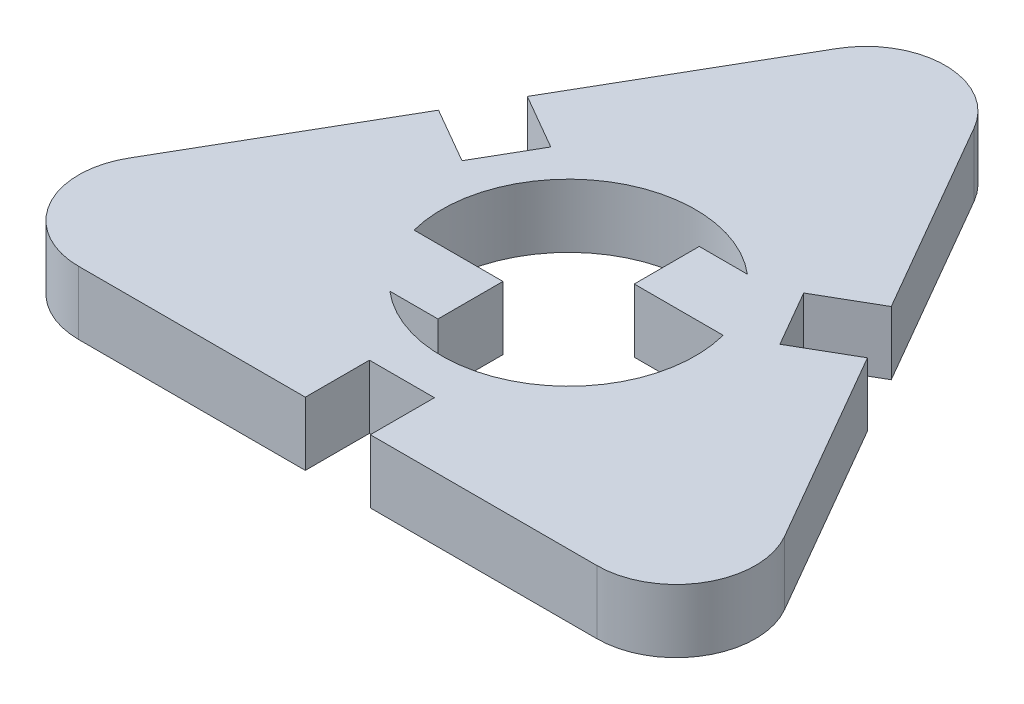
ISO-10303-21;
HEADER;
FILE_DESCRIPTION(('STEP AP214'),'2;1');
FILE_NAME('part.step','',(''),(''),'','','');
FILE_SCHEMA(('AUTOMOTIVE_DESIGN { 1 0 10303 214 1 1 1 1 }'));
ENDSEC;
DATA;
#1=APPLICATION_CONTEXT('core data for automotive mechanical design processes');
#2=APPLICATION_PROTOCOL_DEFINITION('international standard','automotive_design',2000,#1);
#3=PRODUCT_CONTEXT('',#1,'mechanical');
#4=PRODUCT('Part','Part','',(#3));
#5=PRODUCT_RELATED_PRODUCT_CATEGORY('part','',(#4));
#6=PRODUCT_DEFINITION_FORMATION('','',#4);
#7=PRODUCT_DEFINITION_CONTEXT('part definition',#1,'design');
#8=PRODUCT_DEFINITION('design','',#6,#7);
#9=PRODUCT_DEFINITION_SHAPE('','',#8);
#10=(LENGTH_UNIT() NAMED_UNIT(*) SI_UNIT(.MILLI.,.METRE.));
#11=(NAMED_UNIT(*) PLANE_ANGLE_UNIT() SI_UNIT($,.RADIAN.));
#12=(NAMED_UNIT(*) SI_UNIT($,.STERADIAN.) SOLID_ANGLE_UNIT());
#13=UNCERTAINTY_MEASURE_WITH_UNIT(LENGTH_MEASURE(1.E-05),#10,'distance_accuracy_value','');
#14=(GEOMETRIC_REPRESENTATION_CONTEXT(3) GLOBAL_UNCERTAINTY_ASSIGNED_CONTEXT((#13)) GLOBAL_UNIT_ASSIGNED_CONTEXT((#10,
#11,#12)) REPRESENTATION_CONTEXT('',''));
#15=CARTESIAN_POINT('',(0.,0.,0.));
#16=DIRECTION('',(0.,0.,1.));
#17=DIRECTION('',(1.,0.,0.));
#18=AXIS2_PLACEMENT_3D('',#15,#16,#17);
#19=CARTESIAN_POINT('',(2.05000000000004,4.,0.));
#20=DIRECTION('',(1.,0.,0.));
#21=DIRECTION('',(0.,0.,-1.));
#22=AXIS2_PLACEMENT_3D('',#19,#20,#21);
#23=PLANE('',#22);
#24=DIRECTION('',(0.,0.,1.));
#25=VECTOR('',#24,1.);
#26=CARTESIAN_POINT('',(2.05000000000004,0.,0.));
#27=LINE('',#26,#25);
#28=CARTESIAN_POINT('',(2.05000000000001,0.,10.5114568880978));
#29=VERTEX_POINT('',#28);
#30=CARTESIAN_POINT('',(2.04999999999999,0.,14.5536120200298));
#31=VERTEX_POINT('',#30);
#32=EDGE_CURVE('E350',#29,#31,#27,.T.);
#33=ORIENTED_EDGE('',*,*,#32,.T.);
#34=DIRECTION('',(0.,-1.,0.));
#35=VECTOR('',#34,1.);
#36=CARTESIAN_POINT('',(2.04999999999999,4.,14.5536120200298));
#37=LINE('',#36,#35);
#38=CARTESIAN_POINT('',(2.04999999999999,4.,14.5536120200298));
#39=VERTEX_POINT('',#38);
#40=EDGE_CURVE('E440',#39,#31,#37,.T.);
#41=ORIENTED_EDGE('',*,*,#40,.F.);
#42=DIRECTION('',(0.,0.,1.));
#43=VECTOR('',#42,1.);
#44=CARTESIAN_POINT('',(2.05000000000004,4.,0.));
#45=LINE('',#44,#43);
#46=CARTESIAN_POINT('',(2.05000000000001,4.,10.5114568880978));
#47=VERTEX_POINT('',#46);
#48=EDGE_CURVE('E268',#47,#39,#45,.T.);
#49=ORIENTED_EDGE('',*,*,#48,.F.);
#50=DIRECTION('',(0.,-1.,0.));
#51=VECTOR('',#50,1.);
#52=CARTESIAN_POINT('',(2.05000000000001,4.,10.5114568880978));
#53=LINE('',#52,#51);
#54=EDGE_CURVE('E228',#47,#29,#53,.T.);
#55=ORIENTED_EDGE('',*,*,#54,.T.);
#56=EDGE_LOOP('',(#33,#41,#49,#55));
#57=FACE_BOUND('',#56,.T.);
#58=ADVANCED_FACE('F41',(#57),#23,.F.);
#59=CARTESIAN_POINT('',(0.,4.,14.5536120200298));
#60=DIRECTION('',(0.,0.,-1.));
#61=DIRECTION('',(-1.,0.,0.));
#62=AXIS2_PLACEMENT_3D('',#59,#60,#61);
#63=PLANE('',#62);
#64=DIRECTION('',(1.,0.,0.));
#65=VECTOR('',#64,1.);
#66=CARTESIAN_POINT('',(0.,0.,14.5536120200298));
#67=LINE('',#66,#65);
#68=CARTESIAN_POINT('',(16.3397459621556,0.,14.5536120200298));
#69=VERTEX_POINT('',#68);
#70=EDGE_CURVE('E354',#31,#69,#67,.T.);
#71=ORIENTED_EDGE('',*,*,#70,.T.);
#72=DIRECTION('',(0.,-1.,0.));
#73=VECTOR('',#72,1.);
#74=CARTESIAN_POINT('',(16.3397459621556,4.,14.5536120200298));
#75=LINE('',#74,#73);
#76=CARTESIAN_POINT('',(16.3397459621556,4.,14.5536120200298));
#77=VERTEX_POINT('',#76);
#78=EDGE_CURVE('E476',#69,#77,#75,.F.);
#79=ORIENTED_EDGE('',*,*,#78,.T.);
#80=DIRECTION('',(1.,0.,0.));
#81=VECTOR('',#80,1.);
#82=CARTESIAN_POINT('',(0.,4.,14.5536120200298));
#83=LINE('',#82,#81);
#84=EDGE_CURVE('E272',#39,#77,#83,.T.);
#85=ORIENTED_EDGE('',*,*,#84,.F.);
#86=ORIENTED_EDGE('',*,*,#40,.T.);
#87=EDGE_LOOP('',(#71,#79,#85,#86));
#88=FACE_BOUND('',#87,.T.);
#89=ADVANCED_FACE('F541',(#88),#63,.F.);
#90=CARTESIAN_POINT('',(12.4481011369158,4.,-7.18691454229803));
#91=DIRECTION('',(-0.866025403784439,0.,0.5));
#92=DIRECTION('',(0.5,0.,0.866025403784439));
#93=AXIS2_PLACEMENT_3D('',#90,#91,#92);
#94=PLANE('',#93);
#95=DIRECTION('',(-0.5,0.,-0.866025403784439));
#96=VECTOR('',#95,1.);
#97=CARTESIAN_POINT('',(12.4481011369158,4.,-7.18691454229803));
#98=LINE('',#97,#96);
#99=CARTESIAN_POINT('',(20.6698729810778,4.,7.05361202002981));
#100=VERTEX_POINT('',#99);
#101=CARTESIAN_POINT('',(13.525,4.,-5.32167099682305));
#102=VERTEX_POINT('',#101);
#103=EDGE_CURVE('E276',#100,#102,#98,.T.);
#104=ORIENTED_EDGE('',*,*,#103,.F.);
#105=DIRECTION('',(0.,-1.,0.));
#106=VECTOR('',#105,1.);
#107=CARTESIAN_POINT('',(20.6698729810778,4.,7.05361202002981));
#108=LINE('',#107,#106);
#109=CARTESIAN_POINT('',(20.6698729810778,0.,7.05361202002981));
#110=VERTEX_POINT('',#109);
#111=EDGE_CURVE('E444',#100,#110,#108,.T.);
#112=ORIENTED_EDGE('',*,*,#111,.T.);
#113=DIRECTION('',(-0.5,0.,-0.866025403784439));
#114=VECTOR('',#113,1.);
#115=CARTESIAN_POINT('',(12.4481011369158,0.,-7.18691454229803));
#116=LINE('',#115,#114);
#117=CARTESIAN_POINT('',(13.525,0.,-5.32167099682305));
#118=VERTEX_POINT('',#117);
#119=EDGE_CURVE('E358',#110,#118,#116,.T.);
#120=ORIENTED_EDGE('',*,*,#119,.T.);
#121=DIRECTION('',(0.,-1.,0.));
#122=VECTOR('',#121,1.);
#123=CARTESIAN_POINT('',(13.525,4.,-5.32167099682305));
#124=LINE('',#123,#122);
#125=EDGE_CURVE('E436',#102,#118,#124,.T.);
#126=ORIENTED_EDGE('',*,*,#125,.F.);
#127=EDGE_LOOP('',(#104,#112,#120,#126));
#128=FACE_BOUND('',#127,.T.);
#129=ADVANCED_FACE('F549',(#128),#94,.F.);
#130=CARTESIAN_POINT('',(1.07689886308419,4.,1.86524354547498));
#131=DIRECTION('',(-0.5,0.,-0.866025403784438));
#132=DIRECTION('',(-0.866025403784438,0.,0.5));
#133=AXIS2_PLACEMENT_3D('',#130,#131,#132);
#134=PLANE('',#133);
#135=DIRECTION('',(0.866025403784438,0.,-0.5));
#136=VECTOR('',#135,1.);
#137=CARTESIAN_POINT('',(1.07689886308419,0.,1.86524354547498));
#138=LINE('',#137,#136);
#139=CARTESIAN_POINT('',(10.0243909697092,0.,-3.30059343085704));
#140=VERTEX_POINT('',#139);
#141=EDGE_CURVE('E361',#140,#118,#138,.T.);
#142=ORIENTED_EDGE('',*,*,#141,.F.);
#143=DIRECTION('',(0.,-1.,0.));
#144=VECTOR('',#143,1.);
#145=CARTESIAN_POINT('',(10.0243909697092,4.,-3.30059343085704));
#146=LINE('',#145,#144);
#147=CARTESIAN_POINT('',(10.0243909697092,4.,-3.30059343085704));
#148=VERTEX_POINT('',#147);
#149=EDGE_CURVE('E433',#148,#140,#146,.T.);
#150=ORIENTED_EDGE('',*,*,#149,.F.);
#151=DIRECTION('',(0.866025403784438,0.,-0.5));
#152=VECTOR('',#151,1.);
#153=CARTESIAN_POINT('',(1.07689886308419,4.,1.86524354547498));
#154=LINE('',#153,#152);
#155=EDGE_CURVE('E279',#148,#102,#154,.T.);
#156=ORIENTED_EDGE('',*,*,#155,.T.);
#157=ORIENTED_EDGE('',*,*,#125,.T.);
#158=EDGE_LOOP('',(#142,#150,#156,#157));
#159=FACE_BOUND('',#158,.T.);
#160=ADVANCED_FACE('F555',(#159),#134,.T.);
#161=CARTESIAN_POINT('',(8.94749210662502,4.,-5.16583697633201));
#162=DIRECTION('',(-0.866025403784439,0.,0.5));
#163=DIRECTION('',(0.5,0.,0.866025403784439));
#164=AXIS2_PLACEMENT_3D('',#161,#162,#163);
#165=PLANE('',#164);
#166=DIRECTION('',(-0.5,0.,-0.866025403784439));
#167=VECTOR('',#166,1.);
#168=CARTESIAN_POINT('',(8.94749210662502,0.,-5.16583697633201));
#169=LINE('',#168,#167);
#170=CARTESIAN_POINT('',(7.97439096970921,0.,-6.85129758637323));
#171=VERTEX_POINT('',#170);
#172=EDGE_CURVE('E365',#140,#171,#169,.T.);
#173=ORIENTED_EDGE('',*,*,#172,.T.);
#174=DIRECTION('',(0.,-1.,0.));
#175=VECTOR('',#174,1.);
#176=CARTESIAN_POINT('',(7.97439096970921,4.,-6.85129758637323));
#177=LINE('',#176,#175);
#178=CARTESIAN_POINT('',(7.97439096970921,4.,-6.85129758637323));
#179=VERTEX_POINT('',#178);
#180=EDGE_CURVE('E429',#179,#171,#177,.T.);
#181=ORIENTED_EDGE('',*,*,#180,.F.);
#182=DIRECTION('',(-0.5,0.,-0.866025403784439));
#183=VECTOR('',#182,1.);
#184=CARTESIAN_POINT('',(8.94749210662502,4.,-5.16583697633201));
#185=LINE('',#184,#183);
#186=EDGE_CURVE('E283',#148,#179,#185,.T.);
#187=ORIENTED_EDGE('',*,*,#186,.F.);
#188=ORIENTED_EDGE('',*,*,#149,.T.);
#189=EDGE_LOOP('',(#173,#181,#187,#188));
#190=FACE_BOUND('',#189,.T.);
#191=ADVANCED_FACE('F562',(#190),#165,.F.);
#192=CARTESIAN_POINT('',(-0.973101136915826,4.,-1.68546061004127));
#193=DIRECTION('',(-0.499999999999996,0.,-0.866025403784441));
#194=DIRECTION('',(-0.866025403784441,0.,0.499999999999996));
#195=AXIS2_PLACEMENT_3D('',#192,#193,#194);
#196=PLANE('',#195);
#197=DIRECTION('',(0.866025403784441,0.,-0.499999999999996));
#198=VECTOR('',#197,1.);
#199=CARTESIAN_POINT('',(-0.973101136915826,0.,-1.68546061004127));
#200=LINE('',#199,#198);
#201=CARTESIAN_POINT('',(11.475,0.,-8.87237515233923));
#202=VERTEX_POINT('',#201);
#203=EDGE_CURVE('E368',#171,#202,#200,.T.);
#204=ORIENTED_EDGE('',*,*,#203,.T.);
#205=DIRECTION('',(0.,-1.,0.));
#206=VECTOR('',#205,1.);
#207=CARTESIAN_POINT('',(11.475,4.,-8.87237515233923));
#208=LINE('',#207,#206);
#209=CARTESIAN_POINT('',(11.475,4.,-8.87237515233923));
#210=VERTEX_POINT('',#209);
#211=EDGE_CURVE('E425',#210,#202,#208,.T.);
#212=ORIENTED_EDGE('',*,*,#211,.F.);
#213=DIRECTION('',(0.866025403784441,0.,-0.499999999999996));
#214=VECTOR('',#213,1.);
#215=CARTESIAN_POINT('',(-0.973101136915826,4.,-1.68546061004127));
#216=LINE('',#215,#214);
#217=EDGE_CURVE('E286',#179,#210,#216,.T.);
#218=ORIENTED_EDGE('',*,*,#217,.F.);
#219=ORIENTED_EDGE('',*,*,#180,.T.);
#220=EDGE_LOOP('',(#204,#212,#218,#219));
#221=FACE_BOUND('',#220,.T.);
#222=ADVANCED_FACE('F564',(#221),#196,.F.);
#223=CARTESIAN_POINT('',(12.4481011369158,4.,-7.18691454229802));
#224=DIRECTION('',(-0.866025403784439,0.,0.5));
#225=DIRECTION('',(0.5,0.,0.866025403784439));
#226=AXIS2_PLACEMENT_3D('',#223,#224,#225);
#227=PLANE('',#226);
#228=DIRECTION('',(-0.5,0.,-0.866025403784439));
#229=VECTOR('',#228,1.);
#230=CARTESIAN_POINT('',(12.4481011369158,0.,-7.18691454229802));
#231=LINE('',#230,#229);
#232=CARTESIAN_POINT('',(4.3301270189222,0.,-21.2476581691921));
#233=VERTEX_POINT('',#232);
#234=EDGE_CURVE('E371',#202,#233,#231,.T.);
#235=ORIENTED_EDGE('',*,*,#234,.T.);
#236=DIRECTION('',(0.,-1.,0.));
#237=VECTOR('',#236,1.);
#238=CARTESIAN_POINT('',(4.3301270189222,4.,-21.2476581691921));
#239=LINE('',#238,#237);
#240=CARTESIAN_POINT('',(4.3301270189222,4.,-21.2476581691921));
#241=VERTEX_POINT('',#240);
#242=EDGE_CURVE('E11',#233,#241,#239,.F.);
#243=ORIENTED_EDGE('',*,*,#242,.T.);
#244=DIRECTION('',(-0.5,0.,-0.866025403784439));
#245=VECTOR('',#244,1.);
#246=CARTESIAN_POINT('',(12.4481011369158,4.,-7.18691454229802));
#247=LINE('',#246,#245);
#248=EDGE_CURVE('E289',#210,#241,#247,.T.);
#249=ORIENTED_EDGE('',*,*,#248,.F.);
#250=ORIENTED_EDGE('',*,*,#211,.T.);
#251=EDGE_LOOP('',(#235,#243,#249,#250));
#252=FACE_BOUND('',#251,.T.);
#253=ADVANCED_FACE('F567',(#252),#227,.F.);
#254=CARTESIAN_POINT('',(-12.4481011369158,4.,-7.18691454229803));
#255=DIRECTION('',(0.866025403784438,0.,0.5));
#256=DIRECTION('',(0.5,0.,-0.866025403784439));
#257=AXIS2_PLACEMENT_3D('',#254,#255,#256);
#258=PLANE('',#257);
#259=DIRECTION('',(-0.5,0.,0.866025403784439));
#260=VECTOR('',#259,1.);
#261=CARTESIAN_POINT('',(-12.4481011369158,4.,-7.18691454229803));
#262=LINE('',#261,#260);
#263=CARTESIAN_POINT('',(-4.33012701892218,4.,-21.2476581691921));
#264=VERTEX_POINT('',#263);
#265=CARTESIAN_POINT('',(-11.475,4.,-8.87237515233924));
#266=VERTEX_POINT('',#265);
#267=EDGE_CURVE('E293',#264,#266,#262,.T.);
#268=ORIENTED_EDGE('',*,*,#267,.F.);
#269=DIRECTION('',(0.,-1.,0.));
#270=VECTOR('',#269,1.);
#271=CARTESIAN_POINT('',(-4.33012701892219,4.,-21.2476581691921));
#272=LINE('',#271,#270);
#273=CARTESIAN_POINT('',(-4.33012701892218,0.,-21.2476581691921));
#274=VERTEX_POINT('',#273);
#275=EDGE_CURVE('E50',#264,#274,#272,.T.);
#276=ORIENTED_EDGE('',*,*,#275,.T.);
#277=DIRECTION('',(-0.5,0.,0.866025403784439));
#278=VECTOR('',#277,1.);
#279=CARTESIAN_POINT('',(-12.4481011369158,0.,-7.18691454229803));
#280=LINE('',#279,#278);
#281=CARTESIAN_POINT('',(-11.475,0.,-8.87237515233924));
#282=VERTEX_POINT('',#281);
#283=EDGE_CURVE('E375',#274,#282,#280,.T.);
#284=ORIENTED_EDGE('',*,*,#283,.T.);
#285=DIRECTION('',(0.,-1.,0.));
#286=VECTOR('',#285,1.);
#287=CARTESIAN_POINT('',(-11.475,4.,-8.87237515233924));
#288=LINE('',#287,#286);
#289=EDGE_CURVE('E421',#266,#282,#288,.T.);
#290=ORIENTED_EDGE('',*,*,#289,.F.);
#291=EDGE_LOOP('',(#268,#276,#284,#290));
#292=FACE_BOUND('',#291,.T.);
#293=ADVANCED_FACE('F498',(#292),#258,.F.);
#294=CARTESIAN_POINT('',(0.973101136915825,4.,-1.68546061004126));
#295=DIRECTION('',(-0.499999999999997,0.,0.866025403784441));
#296=DIRECTION('',(0.866025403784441,0.,0.499999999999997));
#297=AXIS2_PLACEMENT_3D('',#294,#295,#296);
#298=PLANE('',#297);
#299=DIRECTION('',(-0.866025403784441,0.,-0.499999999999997));
#300=VECTOR('',#299,1.);
#301=CARTESIAN_POINT('',(0.973101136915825,0.,-1.68546061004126));
#302=LINE('',#301,#300);
#303=CARTESIAN_POINT('',(-7.97439096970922,0.,-6.85129758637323));
#304=VERTEX_POINT('',#303);
#305=EDGE_CURVE('E378',#304,#282,#302,.T.);
#306=ORIENTED_EDGE('',*,*,#305,.F.);
#307=DIRECTION('',(0.,-1.,0.));
#308=VECTOR('',#307,1.);
#309=CARTESIAN_POINT('',(-7.97439096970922,4.,-6.85129758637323));
#310=LINE('',#309,#308);
#311=CARTESIAN_POINT('',(-7.97439096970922,4.,-6.85129758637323));
#312=VERTEX_POINT('',#311);
#313=EDGE_CURVE('E418',#312,#304,#310,.T.);
#314=ORIENTED_EDGE('',*,*,#313,.F.);
#315=DIRECTION('',(-0.866025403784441,0.,-0.499999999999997));
#316=VECTOR('',#315,1.);
#317=CARTESIAN_POINT('',(0.973101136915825,4.,-1.68546061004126));
#318=LINE('',#317,#316);
#319=EDGE_CURVE('E296',#312,#266,#318,.T.);
#320=ORIENTED_EDGE('',*,*,#319,.T.);
#321=ORIENTED_EDGE('',*,*,#289,.T.);
#322=EDGE_LOOP('',(#306,#314,#320,#321));
#323=FACE_BOUND('',#322,.T.);
#324=ADVANCED_FACE('F510',(#323),#298,.T.);
#325=CARTESIAN_POINT('',(-8.94749210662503,4.,-5.16583697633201));
#326=DIRECTION('',(-0.866025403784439,0.,-0.5));
#327=DIRECTION('',(-0.5,0.,0.866025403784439));
#328=AXIS2_PLACEMENT_3D('',#325,#326,#327);
#329=PLANE('',#328);
#330=DIRECTION('',(0.5,0.,-0.866025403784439));
#331=VECTOR('',#330,1.);
#332=CARTESIAN_POINT('',(-8.94749210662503,0.,-5.16583697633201));
#333=LINE('',#332,#331);
#334=CARTESIAN_POINT('',(-10.0243909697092,0.,-3.30059343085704));
#335=VERTEX_POINT('',#334);
#336=EDGE_CURVE('E382',#335,#304,#333,.T.);
#337=ORIENTED_EDGE('',*,*,#336,.F.);
#338=DIRECTION('',(0.,-1.,0.));
#339=VECTOR('',#338,1.);
#340=CARTESIAN_POINT('',(-10.0243909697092,4.,-3.30059343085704));
#341=LINE('',#340,#339);
#342=CARTESIAN_POINT('',(-10.0243909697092,4.,-3.30059343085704));
#343=VERTEX_POINT('',#342);
#344=EDGE_CURVE('E415',#343,#335,#341,.T.);
#345=ORIENTED_EDGE('',*,*,#344,.F.);
#346=DIRECTION('',(0.5,0.,-0.866025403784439));
#347=VECTOR('',#346,1.);
#348=CARTESIAN_POINT('',(-8.94749210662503,4.,-5.16583697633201));
#349=LINE('',#348,#347);
#350=EDGE_CURVE('E300',#343,#312,#349,.T.);
#351=ORIENTED_EDGE('',*,*,#350,.T.);
#352=ORIENTED_EDGE('',*,*,#313,.T.);
#353=EDGE_LOOP('',(#337,#345,#351,#352));
#354=FACE_BOUND('',#353,.T.);
#355=ADVANCED_FACE('F514',(#354),#329,.T.);
#356=CARTESIAN_POINT('',(-1.07689886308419,4.,1.86524354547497));
#357=DIRECTION('',(-0.5,0.,0.866025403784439));
#358=DIRECTION('',(0.866025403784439,0.,0.5));
#359=AXIS2_PLACEMENT_3D('',#356,#357,#358);
#360=PLANE('',#359);
#361=DIRECTION('',(-0.866025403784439,0.,-0.5));
#362=VECTOR('',#361,1.);
#363=CARTESIAN_POINT('',(-1.07689886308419,0.,1.86524354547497));
#364=LINE('',#363,#362);
#365=CARTESIAN_POINT('',(-13.525,0.,-5.32167099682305));
#366=VERTEX_POINT('',#365);
#367=EDGE_CURVE('E386',#335,#366,#364,.T.);
#368=ORIENTED_EDGE('',*,*,#367,.T.);
#369=DIRECTION('',(0.,-1.,0.));
#370=VECTOR('',#369,1.);
#371=CARTESIAN_POINT('',(-13.525,4.,-5.32167099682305));
#372=LINE('',#371,#370);
#373=CARTESIAN_POINT('',(-13.525,4.,-5.32167099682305));
#374=VERTEX_POINT('',#373);
#375=EDGE_CURVE('E411',#374,#366,#372,.T.);
#376=ORIENTED_EDGE('',*,*,#375,.F.);
#377=DIRECTION('',(-0.866025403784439,0.,-0.5));
#378=VECTOR('',#377,1.);
#379=CARTESIAN_POINT('',(-1.07689886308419,4.,1.86524354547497));
#380=LINE('',#379,#378);
#381=EDGE_CURVE('E304',#343,#374,#380,.T.);
#382=ORIENTED_EDGE('',*,*,#381,.F.);
#383=ORIENTED_EDGE('',*,*,#344,.T.);
#384=EDGE_LOOP('',(#368,#376,#382,#383));
#385=FACE_BOUND('',#384,.T.);
#386=ADVANCED_FACE('F518',(#385),#360,.F.);
#387=CARTESIAN_POINT('',(-12.4481011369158,4.,-7.18691454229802));
#388=DIRECTION('',(0.866025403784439,0.,0.5));
#389=DIRECTION('',(0.5,0.,-0.866025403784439));
#390=AXIS2_PLACEMENT_3D('',#387,#388,#389);
#391=PLANE('',#390);
#392=DIRECTION('',(-0.5,0.,0.866025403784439));
#393=VECTOR('',#392,1.);
#394=CARTESIAN_POINT('',(-12.4481011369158,0.,-7.18691454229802));
#395=LINE('',#394,#393);
#396=CARTESIAN_POINT('',(-20.6698729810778,0.,7.05361202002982));
#397=VERTEX_POINT('',#396);
#398=EDGE_CURVE('E389',#366,#397,#395,.T.);
#399=ORIENTED_EDGE('',*,*,#398,.T.);
#400=DIRECTION('',(0.,-1.,0.));
#401=VECTOR('',#400,1.);
#402=CARTESIAN_POINT('',(-20.6698729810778,4.,7.05361202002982));
#403=LINE('',#402,#401);
#404=CARTESIAN_POINT('',(-20.6698729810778,4.,7.05361202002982));
#405=VERTEX_POINT('',#404);
#406=EDGE_CURVE('E65',#397,#405,#403,.F.);
#407=ORIENTED_EDGE('',*,*,#406,.T.);
#408=DIRECTION('',(-0.5,0.,0.866025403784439));
#409=VECTOR('',#408,1.);
#410=CARTESIAN_POINT('',(-12.4481011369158,4.,-7.18691454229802));
#411=LINE('',#410,#409);
#412=EDGE_CURVE('E307',#374,#405,#411,.T.);
#413=ORIENTED_EDGE('',*,*,#412,.F.);
#414=ORIENTED_EDGE('',*,*,#375,.T.);
#415=EDGE_LOOP('',(#399,#407,#413,#414));
#416=FACE_BOUND('',#415,.T.);
#417=ADVANCED_FACE('F626',(#416),#391,.F.);
#418=CARTESIAN_POINT('',(0.,4.,14.5536120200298));
#419=DIRECTION('',(0.,0.,-1.));
#420=DIRECTION('',(-1.,0.,0.));
#421=AXIS2_PLACEMENT_3D('',#418,#419,#420);
#422=PLANE('',#421);
#423=DIRECTION('',(1.,0.,0.));
#424=VECTOR('',#423,1.);
#425=CARTESIAN_POINT('',(0.,4.,14.5536120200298));
#426=LINE('',#425,#424);
#427=CARTESIAN_POINT('',(-16.3397459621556,4.,14.5536120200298));
#428=VERTEX_POINT('',#427);
#429=CARTESIAN_POINT('',(-2.04999999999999,4.,14.5536120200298));
#430=VERTEX_POINT('',#429);
#431=EDGE_CURVE('E310',#428,#430,#426,.T.);
#432=ORIENTED_EDGE('',*,*,#431,.F.);
#433=DIRECTION('',(0.,-1.,0.));
#434=VECTOR('',#433,1.);
#435=CARTESIAN_POINT('',(-16.3397459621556,4.,14.5536120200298));
#436=LINE('',#435,#434);
#437=CARTESIAN_POINT('',(-16.3397459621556,0.,14.5536120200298));
#438=VERTEX_POINT('',#437);
#439=EDGE_CURVE('E487',#428,#438,#436,.T.);
#440=ORIENTED_EDGE('',*,*,#439,.T.);
#441=DIRECTION('',(1.,0.,0.));
#442=VECTOR('',#441,1.);
#443=CARTESIAN_POINT('',(0.,0.,14.5536120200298));
#444=LINE('',#443,#442);
#445=CARTESIAN_POINT('',(-2.04999999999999,0.,14.5536120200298));
#446=VERTEX_POINT('',#445);
#447=EDGE_CURVE('E392',#438,#446,#444,.T.);
#448=ORIENTED_EDGE('',*,*,#447,.T.);
#449=DIRECTION('',(0.,-1.,0.));
#450=VECTOR('',#449,1.);
#451=CARTESIAN_POINT('',(-2.04999999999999,4.,14.5536120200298));
#452=LINE('',#451,#450);
#453=EDGE_CURVE('E407',#430,#446,#452,.T.);
#454=ORIENTED_EDGE('',*,*,#453,.F.);
#455=EDGE_LOOP('',(#432,#440,#448,#454));
#456=FACE_BOUND('',#455,.T.);
#457=ADVANCED_FACE('F524',(#456),#422,.F.);
#458=CARTESIAN_POINT('',(-2.04999999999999,4.,0.));
#459=DIRECTION('',(1.,0.,0.));
#460=DIRECTION('',(0.,0.,-1.));
#461=AXIS2_PLACEMENT_3D('',#458,#459,#460);
#462=PLANE('',#461);
#463=DIRECTION('',(0.,0.,1.));
#464=VECTOR('',#463,1.);
#465=CARTESIAN_POINT('',(-2.04999999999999,0.,0.));
#466=LINE('',#465,#464);
#467=CARTESIAN_POINT('',(-2.04999999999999,0.,10.5114568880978));
#468=VERTEX_POINT('',#467);
#469=EDGE_CURVE('E395',#468,#446,#466,.T.);
#470=ORIENTED_EDGE('',*,*,#469,.F.);
#471=DIRECTION('',(0.,-1.,0.));
#472=VECTOR('',#471,1.);
#473=CARTESIAN_POINT('',(-2.04999999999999,4.,10.5114568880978));
#474=LINE('',#473,#472);
#475=CARTESIAN_POINT('',(-2.04999999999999,4.,10.5114568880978));
#476=VERTEX_POINT('',#475);
#477=EDGE_CURVE('E404',#476,#468,#474,.T.);
#478=ORIENTED_EDGE('',*,*,#477,.F.);
#479=DIRECTION('',(0.,0.,1.));
#480=VECTOR('',#479,1.);
#481=CARTESIAN_POINT('',(-2.04999999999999,4.,0.));
#482=LINE('',#481,#480);
#483=EDGE_CURVE('E313',#476,#430,#482,.T.);
#484=ORIENTED_EDGE('',*,*,#483,.T.);
#485=ORIENTED_EDGE('',*,*,#453,.T.);
#486=EDGE_LOOP('',(#470,#478,#484,#485));
#487=FACE_BOUND('',#486,.T.);
#488=ADVANCED_FACE('F531',(#487),#462,.T.);
#489=CARTESIAN_POINT('',(0.,4.,2.00000000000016));
#490=DIRECTION('',(0.,0.,-1.));
#491=DIRECTION('',(-1.,0.,0.));
#492=AXIS2_PLACEMENT_3D('',#489,#490,#491);
#493=PLANE('',#492);
#494=DIRECTION('',(1.,0.,0.));
#495=VECTOR('',#494,1.);
#496=CARTESIAN_POINT('',(0.,0.,2.00000000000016));
#497=LINE('',#496,#495);
#498=CARTESIAN_POINT('',(-7.74596669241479,0.,2.00000000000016));
#499=VERTEX_POINT('',#498);
#500=CARTESIAN_POINT('',(-2.14004370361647,0.,2.00000000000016));
#501=VERTEX_POINT('',#500);
#502=EDGE_CURVE('E222',#499,#501,#497,.T.);
#503=ORIENTED_EDGE('',*,*,#502,.F.);
#504=DIRECTION('',(0.,-1.,0.));
#505=VECTOR('',#504,1.);
#506=CARTESIAN_POINT('',(-7.74596669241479,4.,2.00000000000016));
#507=LINE('',#506,#505);
#508=CARTESIAN_POINT('',(-7.74596669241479,4.,2.00000000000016));
#509=VERTEX_POINT('',#508);
#510=EDGE_CURVE('E216',#509,#499,#507,.T.);
#511=ORIENTED_EDGE('',*,*,#510,.F.);
#512=DIRECTION('',(1.,0.,0.));
#513=VECTOR('',#512,1.);
#514=CARTESIAN_POINT('',(0.,4.,2.00000000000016));
#515=LINE('',#514,#513);
#516=CARTESIAN_POINT('',(-2.14004370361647,4.,2.00000000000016));
#517=VERTEX_POINT('',#516);
#518=EDGE_CURVE('E219',#509,#517,#515,.T.);
#519=ORIENTED_EDGE('',*,*,#518,.T.);
#520=DIRECTION('',(0.,-1.,0.));
#521=VECTOR('',#520,1.);
#522=CARTESIAN_POINT('',(-2.14004370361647,4.,2.00000000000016));
#523=LINE('',#522,#521);
#524=EDGE_CURVE('E320',#517,#501,#523,.T.);
#525=ORIENTED_EDGE('',*,*,#524,.T.);
#526=EDGE_LOOP('',(#503,#511,#519,#525));
#527=FACE_BOUND('',#526,.T.);
#528=ADVANCED_FACE('F218',(#527),#493,.T.);
#529=CARTESIAN_POINT('',(0.,4.,0.));
#530=DIRECTION('',(0.,-1.,0.));
#531=DIRECTION('',(0.,0.,-1.));
#532=AXIS2_PLACEMENT_3D('',#529,#530,#531);
#533=CYLINDRICAL_SURFACE('',#532,8.);
#534=CARTESIAN_POINT('',(0.,0.,0.));
#535=DIRECTION('',(0.,1.,0.));
#536=DIRECTION('',(0.,0.,1.));
#537=AXIS2_PLACEMENT_3D('',#534,#535,#536);
#538=CIRCLE('',#537,8.);
#539=CARTESIAN_POINT('',(5.17590571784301,0.,-6.1));
#540=VERTEX_POINT('',#539);
#541=EDGE_CURVE('E323',#540,#499,#538,.T.);
#542=ORIENTED_EDGE('',*,*,#541,.F.);
#543=DIRECTION('',(0.,-1.,0.));
#544=VECTOR('',#543,1.);
#545=CARTESIAN_POINT('',(5.17590571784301,4.,-6.1));
#546=LINE('',#545,#544);
#547=CARTESIAN_POINT('',(5.17590571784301,4.,-6.1));
#548=VERTEX_POINT('',#547);
#549=EDGE_CURVE('E229',#548,#540,#546,.T.);
#550=ORIENTED_EDGE('',*,*,#549,.F.);
#551=CARTESIAN_POINT('',(0.,4.,0.));
#552=DIRECTION('',(0.,1.,0.));
#553=DIRECTION('',(0.,0.,1.));
#554=AXIS2_PLACEMENT_3D('',#551,#552,#553);
#555=CIRCLE('',#554,8.);
#556=EDGE_CURVE('E235',#548,#509,#555,.T.);
#557=ORIENTED_EDGE('',*,*,#556,.T.);
#558=ORIENTED_EDGE('',*,*,#510,.T.);
#559=EDGE_LOOP('',(#542,#550,#557,#558));
#560=FACE_BOUND('',#559,.T.);
#561=ADVANCED_FACE('F243',(#560),#533,.F.);
#562=CARTESIAN_POINT('',(0.,4.,-6.1));
#563=DIRECTION('',(0.,0.,-1.));
#564=DIRECTION('',(-1.,0.,0.));
#565=AXIS2_PLACEMENT_3D('',#562,#563,#564);
#566=PLANE('',#565);
#567=DIRECTION('',(1.,0.,0.));
#568=VECTOR('',#567,1.);
#569=CARTESIAN_POINT('',(0.,0.,-6.1));
#570=LINE('',#569,#568);
#571=CARTESIAN_POINT('',(2.1400437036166,0.,-6.1));
#572=VERTEX_POINT('',#571);
#573=EDGE_CURVE('E326',#572,#540,#570,.T.);
#574=ORIENTED_EDGE('',*,*,#573,.F.);
#575=DIRECTION('',(0.,-1.,0.));
#576=VECTOR('',#575,1.);
#577=CARTESIAN_POINT('',(2.1400437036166,4.,-6.1));
#578=LINE('',#577,#576);
#579=CARTESIAN_POINT('',(2.1400437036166,4.,-6.1));
#580=VERTEX_POINT('',#579);
#581=EDGE_CURVE('E459',#580,#572,#578,.T.);
#582=ORIENTED_EDGE('',*,*,#581,.F.);
#583=DIRECTION('',(1.,0.,0.));
#584=VECTOR('',#583,1.);
#585=CARTESIAN_POINT('',(0.,4.,-6.1));
#586=LINE('',#585,#584);
#587=EDGE_CURVE('E245',#580,#548,#586,.T.);
#588=ORIENTED_EDGE('',*,*,#587,.T.);
#589=ORIENTED_EDGE('',*,*,#549,.T.);
#590=EDGE_LOOP('',(#574,#582,#588,#589));
#591=FACE_BOUND('',#590,.T.);
#592=ADVANCED_FACE('F600',(#591),#566,.T.);
#593=CARTESIAN_POINT('',(2.1400437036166,4.,0.));
#594=DIRECTION('',(-1.,0.,0.));
#595=DIRECTION('',(0.,0.,1.));
#596=AXIS2_PLACEMENT_3D('',#593,#594,#595);
#597=PLANE('',#596);
#598=DIRECTION('',(0.,0.,-1.));
#599=VECTOR('',#598,1.);
#600=CARTESIAN_POINT('',(2.1400437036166,0.,0.));
#601=LINE('',#600,#599);
#602=CARTESIAN_POINT('',(2.1400437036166,0.,-2.));
#603=VERTEX_POINT('',#602);
#604=EDGE_CURVE('E330',#603,#572,#601,.T.);
#605=ORIENTED_EDGE('',*,*,#604,.F.);
#606=DIRECTION('',(0.,-1.,0.));
#607=VECTOR('',#606,1.);
#608=CARTESIAN_POINT('',(2.1400437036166,4.,-2.));
#609=LINE('',#608,#607);
#610=CARTESIAN_POINT('',(2.1400437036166,4.,-2.));
#611=VERTEX_POINT('',#610);
#612=EDGE_CURVE('E456',#611,#603,#609,.T.);
#613=ORIENTED_EDGE('',*,*,#612,.F.);
#614=DIRECTION('',(0.,0.,-1.));
#615=VECTOR('',#614,1.);
#616=CARTESIAN_POINT('',(2.1400437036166,4.,0.));
#617=LINE('',#616,#615);
#618=EDGE_CURVE('E248',#611,#580,#617,.T.);
#619=ORIENTED_EDGE('',*,*,#618,.T.);
#620=ORIENTED_EDGE('',*,*,#581,.T.);
#621=EDGE_LOOP('',(#605,#613,#619,#620));
#622=FACE_BOUND('',#621,.T.);
#623=ADVANCED_FACE('F596',(#622),#597,.T.);
#624=CARTESIAN_POINT('',(0.,4.,-2.));
#625=DIRECTION('',(0.,0.,1.));
#626=DIRECTION('',(1.,0.,0.));
#627=AXIS2_PLACEMENT_3D('',#624,#625,#626);
#628=PLANE('',#627);
#629=DIRECTION('',(-1.,0.,0.));
#630=VECTOR('',#629,1.);
#631=CARTESIAN_POINT('',(0.,0.,-2.));
#632=LINE('',#631,#630);
#633=CARTESIAN_POINT('',(7.74596669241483,0.,-2.));
#634=VERTEX_POINT('',#633);
#635=EDGE_CURVE('E334',#634,#603,#632,.T.);
#636=ORIENTED_EDGE('',*,*,#635,.F.);
#637=DIRECTION('',(0.,-1.,0.));
#638=VECTOR('',#637,1.);
#639=CARTESIAN_POINT('',(7.74596669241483,4.,-2.));
#640=LINE('',#639,#638);
#641=CARTESIAN_POINT('',(7.74596669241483,4.,-2.));
#642=VERTEX_POINT('',#641);
#643=EDGE_CURVE('E453',#642,#634,#640,.T.);
#644=ORIENTED_EDGE('',*,*,#643,.F.);
#645=DIRECTION('',(-1.,0.,0.));
#646=VECTOR('',#645,1.);
#647=CARTESIAN_POINT('',(0.,4.,-2.));
#648=LINE('',#647,#646);
#649=EDGE_CURVE('E254',#642,#611,#648,.T.);
#650=ORIENTED_EDGE('',*,*,#649,.T.);
#651=ORIENTED_EDGE('',*,*,#612,.T.);
#652=EDGE_LOOP('',(#636,#644,#650,#651));
#653=FACE_BOUND('',#652,.T.);
#654=ADVANCED_FACE('F592',(#653),#628,.T.);
#655=CARTESIAN_POINT('',(0.,4.,0.));
#656=DIRECTION('',(0.,-1.,0.));
#657=DIRECTION('',(0.,0.,-1.));
#658=AXIS2_PLACEMENT_3D('',#655,#656,#657);
#659=CYLINDRICAL_SURFACE('',#658,8.);
#660=CARTESIAN_POINT('',(0.,0.,0.));
#661=DIRECTION('',(0.,1.,0.));
#662=DIRECTION('',(0.,0.,1.));
#663=AXIS2_PLACEMENT_3D('',#660,#661,#662);
#664=CIRCLE('',#663,8.);
#665=CARTESIAN_POINT('',(-5.17590571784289,0.,6.10000000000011));
#666=VERTEX_POINT('',#665);
#667=EDGE_CURVE('E338',#666,#634,#664,.T.);
#668=ORIENTED_EDGE('',*,*,#667,.F.);
#669=DIRECTION('',(0.,-1.,0.));
#670=VECTOR('',#669,1.);
#671=CARTESIAN_POINT('',(-5.17590571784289,4.,6.10000000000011));
#672=LINE('',#671,#670);
#673=CARTESIAN_POINT('',(-5.17590571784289,4.,6.10000000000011));
#674=VERTEX_POINT('',#673);
#675=EDGE_CURVE('E450',#674,#666,#672,.T.);
#676=ORIENTED_EDGE('',*,*,#675,.F.);
#677=CARTESIAN_POINT('',(0.,4.,0.));
#678=DIRECTION('',(0.,1.,0.));
#679=DIRECTION('',(0.,0.,1.));
#680=AXIS2_PLACEMENT_3D('',#677,#678,#679);
#681=CIRCLE('',#680,8.);
#682=EDGE_CURVE('E258',#674,#642,#681,.T.);
#683=ORIENTED_EDGE('',*,*,#682,.T.);
#684=ORIENTED_EDGE('',*,*,#643,.T.);
#685=EDGE_LOOP('',(#668,#676,#683,#684));
#686=FACE_BOUND('',#685,.T.);
#687=ADVANCED_FACE('F588',(#686),#659,.F.);
#688=CARTESIAN_POINT('',(1.27224551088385E-13,4.,6.1));
#689=DIRECTION('',(0.,0.,1.));
#690=DIRECTION('',(1.,0.,0.));
#691=AXIS2_PLACEMENT_3D('',#688,#689,#690);
#692=PLANE('',#691);
#693=DIRECTION('',(-1.,0.,0.));
#694=VECTOR('',#693,1.);
#695=CARTESIAN_POINT('',(1.27224551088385E-13,0.,6.1));
#696=LINE('',#695,#694);
#697=CARTESIAN_POINT('',(-2.14004370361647,0.,6.10000000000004));
#698=VERTEX_POINT('',#697);
#699=EDGE_CURVE('E342',#698,#666,#696,.T.);
#700=ORIENTED_EDGE('',*,*,#699,.F.);
#701=DIRECTION('',(0.,-1.,0.));
#702=VECTOR('',#701,1.);
#703=CARTESIAN_POINT('',(-2.14004370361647,4.,6.10000000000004));
#704=LINE('',#703,#702);
#705=CARTESIAN_POINT('',(-2.14004370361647,4.,6.10000000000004));
#706=VERTEX_POINT('',#705);
#707=EDGE_CURVE('E447',#706,#698,#704,.T.);
#708=ORIENTED_EDGE('',*,*,#707,.F.);
#709=DIRECTION('',(-1.,0.,0.));
#710=VECTOR('',#709,1.);
#711=CARTESIAN_POINT('',(1.27224551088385E-13,4.,6.1));
#712=LINE('',#711,#710);
#713=EDGE_CURVE('E262',#706,#674,#712,.T.);
#714=ORIENTED_EDGE('',*,*,#713,.T.);
#715=ORIENTED_EDGE('',*,*,#675,.T.);
#716=EDGE_LOOP('',(#700,#708,#714,#715));
#717=FACE_BOUND('',#716,.T.);
#718=ADVANCED_FACE('F584',(#717),#692,.T.);
#719=CARTESIAN_POINT('',(-2.14004370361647,4.,0.));
#720=DIRECTION('',(1.,0.,0.));
#721=DIRECTION('',(0.,0.,-1.));
#722=AXIS2_PLACEMENT_3D('',#719,#720,#721);
#723=PLANE('',#722);
#724=DIRECTION('',(0.,0.,1.));
#725=VECTOR('',#724,1.);
#726=CARTESIAN_POINT('',(-2.14004370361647,0.,0.));
#727=LINE('',#726,#725);
#728=EDGE_CURVE('E346',#501,#698,#727,.T.);
#729=ORIENTED_EDGE('',*,*,#728,.F.);
#730=ORIENTED_EDGE('',*,*,#524,.F.);
#731=DIRECTION('',(0.,0.,1.));
#732=VECTOR('',#731,1.);
#733=CARTESIAN_POINT('',(-2.14004370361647,4.,0.));
#734=LINE('',#733,#732);
#735=EDGE_CURVE('E239',#517,#706,#734,.T.);
#736=ORIENTED_EDGE('',*,*,#735,.T.);
#737=ORIENTED_EDGE('',*,*,#707,.T.);
#738=EDGE_LOOP('',(#729,#730,#736,#737));
#739=FACE_BOUND('',#738,.T.);
#740=ADVANCED_FACE('F581',(#739),#723,.T.);
#741=CARTESIAN_POINT('',(0.,4.,10.5114568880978));
#742=DIRECTION('',(0.,0.,-1.));
#743=DIRECTION('',(-1.,0.,0.));
#744=AXIS2_PLACEMENT_3D('',#741,#742,#743);
#745=PLANE('',#744);
#746=DIRECTION('',(1.,0.,0.));
#747=VECTOR('',#746,1.);
#748=CARTESIAN_POINT('',(0.,0.,10.5114568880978));
#749=LINE('',#748,#747);
#750=EDGE_CURVE('E241',#468,#29,#749,.T.);
#751=ORIENTED_EDGE('',*,*,#750,.T.);
#752=ORIENTED_EDGE('',*,*,#54,.F.);
#753=DIRECTION('',(1.,0.,0.));
#754=VECTOR('',#753,1.);
#755=CARTESIAN_POINT('',(0.,4.,10.5114568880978));
#756=LINE('',#755,#754);
#757=EDGE_CURVE('E317',#476,#47,#756,.T.);
#758=ORIENTED_EDGE('',*,*,#757,.F.);
#759=ORIENTED_EDGE('',*,*,#477,.T.);
#760=EDGE_LOOP('',(#751,#752,#758,#759));
#761=FACE_BOUND('',#760,.T.);
#762=ADVANCED_FACE('F538',(#761),#745,.F.);
#763=CARTESIAN_POINT('',(0.,4.,0.));
#764=DIRECTION('',(0.,1.,0.));
#765=DIRECTION('',(0.,0.,1.));
#766=AXIS2_PLACEMENT_3D('',#763,#764,#765);
#767=PLANE('',#766);
#768=ORIENTED_EDGE('',*,*,#518,.F.);
#769=ORIENTED_EDGE('',*,*,#556,.F.);
#770=ORIENTED_EDGE('',*,*,#587,.F.);
#771=ORIENTED_EDGE('',*,*,#618,.F.);
#772=ORIENTED_EDGE('',*,*,#649,.F.);
#773=ORIENTED_EDGE('',*,*,#682,.F.);
#774=ORIENTED_EDGE('',*,*,#713,.F.);
#775=ORIENTED_EDGE('',*,*,#735,.F.);
#776=EDGE_LOOP('',(#768,#769,#770,#771,#772,#773,#774,#775));
#777=FACE_BOUND('',#776,.T.);
#778=ORIENTED_EDGE('',*,*,#84,.T.);
#779=CARTESIAN_POINT('',(16.3397459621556,4.,9.55361202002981));
#780=DIRECTION('',(0.,1.,0.));
#781=DIRECTION('',(0.,0.,1.));
#782=AXIS2_PLACEMENT_3D('',#779,#780,#781);
#783=CIRCLE('',#782,5.);
#784=EDGE_CURVE('E484',#77,#100,#783,.T.);
#785=ORIENTED_EDGE('',*,*,#784,.T.);
#786=ORIENTED_EDGE('',*,*,#103,.T.);
#787=ORIENTED_EDGE('',*,*,#155,.F.);
#788=ORIENTED_EDGE('',*,*,#186,.T.);
#789=ORIENTED_EDGE('',*,*,#217,.T.);
#790=ORIENTED_EDGE('',*,*,#248,.T.);
#791=CARTESIAN_POINT('',(0.,4.,-18.7476581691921));
#792=DIRECTION('',(0.,1.,0.));
#793=DIRECTION('',(0.,0.,1.));
#794=AXIS2_PLACEMENT_3D('',#791,#792,#793);
#795=CIRCLE('',#794,5.);
#796=EDGE_CURVE('E479',#241,#264,#795,.T.);
#797=ORIENTED_EDGE('',*,*,#796,.T.);
#798=ORIENTED_EDGE('',*,*,#267,.T.);
#799=ORIENTED_EDGE('',*,*,#319,.F.);
#800=ORIENTED_EDGE('',*,*,#350,.F.);
#801=ORIENTED_EDGE('',*,*,#381,.T.);
#802=ORIENTED_EDGE('',*,*,#412,.T.);
#803=CARTESIAN_POINT('',(-16.3397459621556,4.,9.55361202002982));
#804=DIRECTION('',(0.,1.,0.));
#805=DIRECTION('',(0.,0.,1.));
#806=AXIS2_PLACEMENT_3D('',#803,#804,#805);
#807=CIRCLE('',#806,5.);
#808=EDGE_CURVE('E57',#405,#428,#807,.T.);
#809=ORIENTED_EDGE('',*,*,#808,.T.);
#810=ORIENTED_EDGE('',*,*,#431,.T.);
#811=ORIENTED_EDGE('',*,*,#483,.F.);
#812=ORIENTED_EDGE('',*,*,#757,.T.);
#813=ORIENTED_EDGE('',*,*,#48,.T.);
#814=EDGE_LOOP('',(#778,#785,#786,#787,#788,#789,#790,#797,#798,#799,#800,#801,#802,#809,#810,
#811,#812,#813));
#815=FACE_BOUND('',#814,.T.);
#816=ADVANCED_FACE('F233',(#777,#815),#767,.T.);
#817=CARTESIAN_POINT('',(0.,0.,0.));
#818=DIRECTION('',(0.,1.,0.));
#819=DIRECTION('',(0.,0.,1.));
#820=AXIS2_PLACEMENT_3D('',#817,#818,#819);
#821=PLANE('',#820);
#822=ORIENTED_EDGE('',*,*,#502,.T.);
#823=ORIENTED_EDGE('',*,*,#728,.T.);
#824=ORIENTED_EDGE('',*,*,#699,.T.);
#825=ORIENTED_EDGE('',*,*,#667,.T.);
#826=ORIENTED_EDGE('',*,*,#635,.T.);
#827=ORIENTED_EDGE('',*,*,#604,.T.);
#828=ORIENTED_EDGE('',*,*,#573,.T.);
#829=ORIENTED_EDGE('',*,*,#541,.T.);
#830=EDGE_LOOP('',(#822,#823,#824,#825,#826,#827,#828,#829));
#831=FACE_BOUND('',#830,.T.);
#832=ORIENTED_EDGE('',*,*,#119,.F.);
#833=CARTESIAN_POINT('',(16.3397459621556,0.,9.55361202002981));
#834=DIRECTION('',(0.,1.,0.));
#835=DIRECTION('',(0.,0.,1.));
#836=AXIS2_PLACEMENT_3D('',#833,#834,#835);
#837=CIRCLE('',#836,5.);
#838=EDGE_CURVE('E473',#110,#69,#837,.F.);
#839=ORIENTED_EDGE('',*,*,#838,.T.);
#840=ORIENTED_EDGE('',*,*,#70,.F.);
#841=ORIENTED_EDGE('',*,*,#32,.F.);
#842=ORIENTED_EDGE('',*,*,#750,.F.);
#843=ORIENTED_EDGE('',*,*,#469,.T.);
#844=ORIENTED_EDGE('',*,*,#447,.F.);
#845=CARTESIAN_POINT('',(-16.3397459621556,0.,9.55361202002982));
#846=DIRECTION('',(0.,1.,0.));
#847=DIRECTION('',(0.,0.,1.));
#848=AXIS2_PLACEMENT_3D('',#845,#846,#847);
#849=CIRCLE('',#848,5.);
#850=EDGE_CURVE('E470',#438,#397,#849,.F.);
#851=ORIENTED_EDGE('',*,*,#850,.T.);
#852=ORIENTED_EDGE('',*,*,#398,.F.);
#853=ORIENTED_EDGE('',*,*,#367,.F.);
#854=ORIENTED_EDGE('',*,*,#336,.T.);
#855=ORIENTED_EDGE('',*,*,#305,.T.);
#856=ORIENTED_EDGE('',*,*,#283,.F.);
#857=CARTESIAN_POINT('',(0.,0.,-18.7476581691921));
#858=DIRECTION('',(0.,1.,0.));
#859=DIRECTION('',(0.,0.,1.));
#860=AXIS2_PLACEMENT_3D('',#857,#858,#859);
#861=CIRCLE('',#860,5.);
#862=EDGE_CURVE('E467',#274,#233,#861,.F.);
#863=ORIENTED_EDGE('',*,*,#862,.T.);
#864=ORIENTED_EDGE('',*,*,#234,.F.);
#865=ORIENTED_EDGE('',*,*,#203,.F.);
#866=ORIENTED_EDGE('',*,*,#172,.F.);
#867=ORIENTED_EDGE('',*,*,#141,.T.);
#868=EDGE_LOOP('',(#832,#839,#840,#841,#842,#843,#844,#851,#852,#853,#854,#855,#856,#863,#864,
#865,#866,#867));
#869=FACE_BOUND('',#868,.T.);
#870=ADVANCED_FACE('F504',(#831,#869),#821,.F.);
#871=CARTESIAN_POINT('',(16.3397459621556,4.,9.55361202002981));
#872=DIRECTION('',(0.,-1.,0.));
#873=DIRECTION('',(0.,0.,-1.));
#874=AXIS2_PLACEMENT_3D('',#871,#872,#873);
#875=CYLINDRICAL_SURFACE('',#874,5.);
#876=ORIENTED_EDGE('',*,*,#784,.F.);
#877=ORIENTED_EDGE('',*,*,#78,.F.);
#878=ORIENTED_EDGE('',*,*,#838,.F.);
#879=ORIENTED_EDGE('',*,*,#111,.F.);
#880=EDGE_LOOP('',(#876,#877,#878,#879));
#881=FACE_BOUND('',#880,.T.);
#882=ADVANCED_FACE('F547',(#881),#875,.T.);
#883=CARTESIAN_POINT('',(-16.3397459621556,4.,9.55361202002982));
#884=DIRECTION('',(0.,-1.,0.));
#885=DIRECTION('',(0.,0.,-1.));
#886=AXIS2_PLACEMENT_3D('',#883,#884,#885);
#887=CYLINDRICAL_SURFACE('',#886,5.);
#888=ORIENTED_EDGE('',*,*,#808,.F.);
#889=ORIENTED_EDGE('',*,*,#406,.F.);
#890=ORIENTED_EDGE('',*,*,#850,.F.);
#891=ORIENTED_EDGE('',*,*,#439,.F.);
#892=EDGE_LOOP('',(#888,#889,#890,#891));
#893=FACE_BOUND('',#892,.T.);
#894=ADVANCED_FACE('F521',(#893),#887,.T.);
#895=CARTESIAN_POINT('',(0.,4.,-18.7476581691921));
#896=DIRECTION('',(0.,-1.,0.));
#897=DIRECTION('',(0.,0.,-1.));
#898=AXIS2_PLACEMENT_3D('',#895,#896,#897);
#899=CYLINDRICAL_SURFACE('',#898,5.);
#900=ORIENTED_EDGE('',*,*,#796,.F.);
#901=ORIENTED_EDGE('',*,*,#242,.F.);
#902=ORIENTED_EDGE('',*,*,#862,.F.);
#903=ORIENTED_EDGE('',*,*,#275,.F.);
#904=EDGE_LOOP('',(#900,#901,#902,#903));
#905=FACE_BOUND('',#904,.T.);
#906=ADVANCED_FACE('F43',(#905),#899,.T.);
#907=CLOSED_SHELL('',(#58,#89,#129,#160,#191,#222,#253,#293,#324,#355,#386,#417,#457,#488,#528,
#561,#592,#623,#654,#687,#718,#740,#762,#816,#870,#882,#894,#906));
#908=MANIFOLD_SOLID_BREP('B2',#907);
#909=ADVANCED_BREP_SHAPE_REPRESENTATION('',(#18,#908),#14);
#910=SHAPE_DEFINITION_REPRESENTATION(#9,#909);
ENDSEC;
END-ISO-10303-21;
